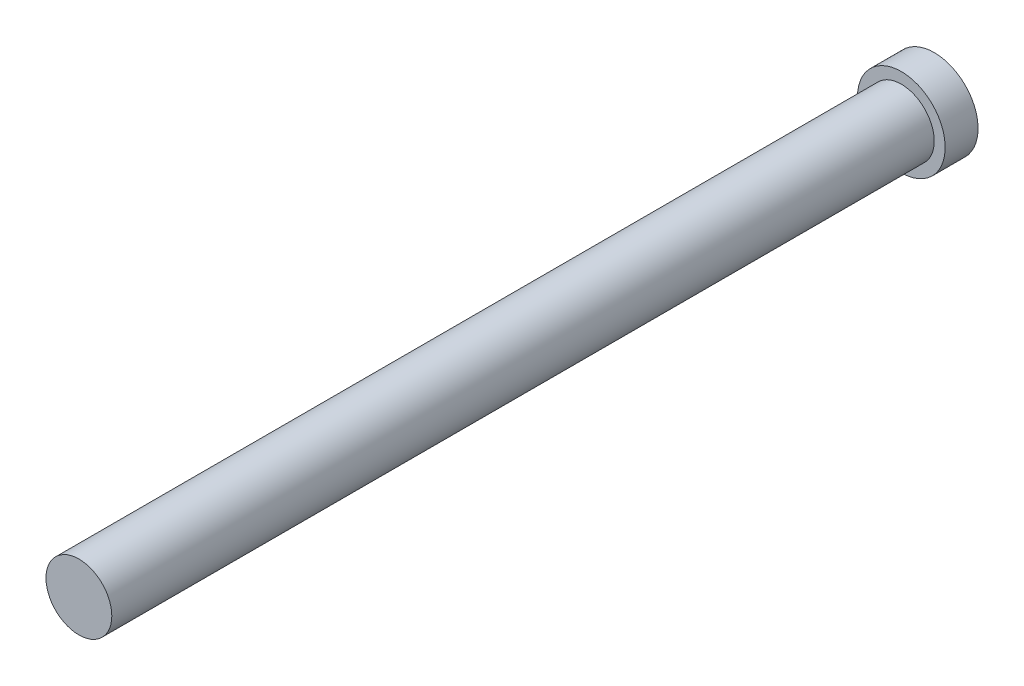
from build123d import *

# Parameters (mm, degrees)
SKETCH_1_R          = 1.5
EXTRUDE_1_DEPTH     = 37.5
SKETCH_2_R          = 2
EXTRUDE_2_DEPTH     = 1.5
CUT_EXTRUDE_1_DEPTH = 1


with BuildPart() as part:
    # Sketch 1 → Extrude 1 (new body)
    with BuildSketch(Plane.XY):
        Circle(SKETCH_1_R)
    extrude(amount=EXTRUDE_1_DEPTH)

    # Sketch 2 → Extrude 2 (add)
    with BuildSketch(Plane(origin=(0, 0, 0), x_dir=(-1, 0, 0), z_dir=(0, 0, -1))):
        Circle(SKETCH_2_R)
    extrude(amount=EXTRUDE_2_DEPTH)

    # Sketch 3 → Cut-Extrude 1 (cut)
    with BuildSketch(Plane(origin=(0, 0, -1.5), x_dir=(-1, 0, 0), z_dir=(0, 0, -1))):
        Polygon((-0.29679589, 0.304992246), (-1.735679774, 0.304992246), (-1.735679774, -0.304992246), (-0.29679589, -0.304992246), (-0.29679589, -1.689035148), (0.29679589, -1.689035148), (0.29679589, -0.304992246), (1.735679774, -0.304992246), (1.735679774, 0.304992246), (0.29679589, 0.304992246), (0.29679589, 1.689035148), (-0.29679589, 1.689035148), align=None)
    extrude(amount=-CUT_EXTRUDE_1_DEPTH, mode=Mode.SUBTRACT)


solid = part.part
